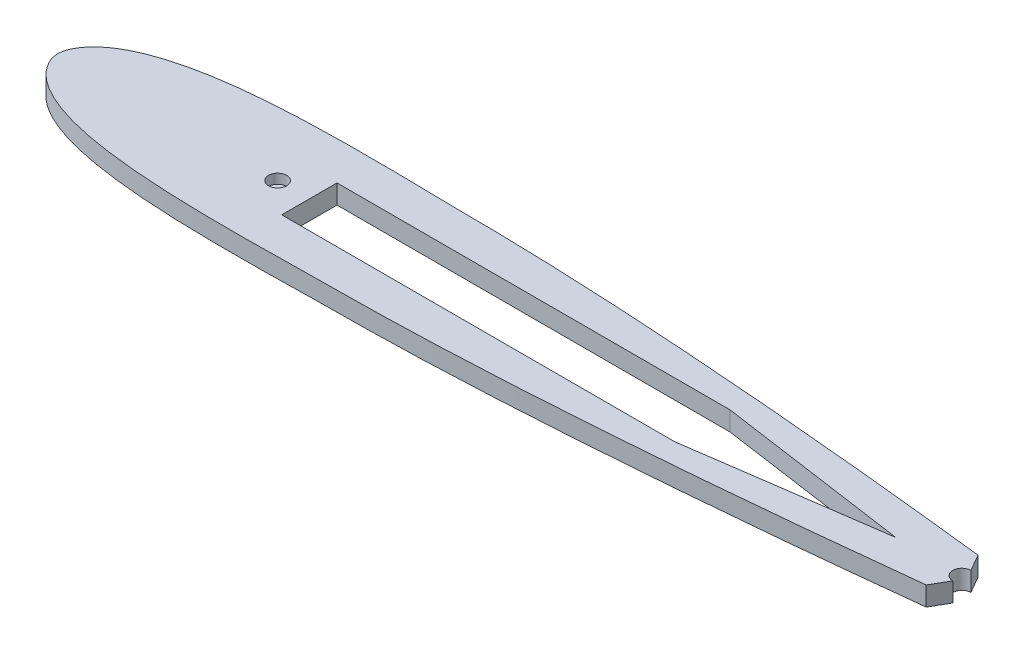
ISO-10303-21;
HEADER;
FILE_DESCRIPTION(('STEP AP214'),'2;1');
FILE_NAME('part.step','',(''),(''),'','','');
FILE_SCHEMA(('AUTOMOTIVE_DESIGN { 1 0 10303 214 1 1 1 1 }'));
ENDSEC;
DATA;
#1=APPLICATION_CONTEXT('core data for automotive mechanical design processes');
#2=APPLICATION_PROTOCOL_DEFINITION('international standard','automotive_design',2000,#1);
#3=PRODUCT_CONTEXT('',#1,'mechanical');
#4=PRODUCT('Part','Part','',(#3));
#5=PRODUCT_RELATED_PRODUCT_CATEGORY('part','',(#4));
#6=PRODUCT_DEFINITION_FORMATION('','',#4);
#7=PRODUCT_DEFINITION_CONTEXT('part definition',#1,'design');
#8=PRODUCT_DEFINITION('design','',#6,#7);
#9=PRODUCT_DEFINITION_SHAPE('','',#8);
#10=(LENGTH_UNIT() NAMED_UNIT(*) SI_UNIT(.MILLI.,.METRE.));
#11=(NAMED_UNIT(*) PLANE_ANGLE_UNIT() SI_UNIT($,.RADIAN.));
#12=(NAMED_UNIT(*) SI_UNIT($,.STERADIAN.) SOLID_ANGLE_UNIT());
#13=UNCERTAINTY_MEASURE_WITH_UNIT(LENGTH_MEASURE(1.E-05),#10,'distance_accuracy_value','');
#14=(GEOMETRIC_REPRESENTATION_CONTEXT(3) GLOBAL_UNCERTAINTY_ASSIGNED_CONTEXT((#13)) GLOBAL_UNIT_ASSIGNED_CONTEXT((#10,
#11,#12)) REPRESENTATION_CONTEXT('',''));
#15=CARTESIAN_POINT('',(0.,0.,0.));
#16=DIRECTION('',(0.,0.,1.));
#17=DIRECTION('',(1.,0.,0.));
#18=AXIS2_PLACEMENT_3D('',#15,#16,#17);
#19=CARTESIAN_POINT('',(90.9739313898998,3.175,-0.00918534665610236));
#20=CARTESIAN_POINT('',(87.4484605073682,3.175,-0.494912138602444));
#21=CARTESIAN_POINT('',(80.9276456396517,3.175,-1.40033353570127));
#22=CARTESIAN_POINT('',(71.3994868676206,3.175,-2.61549267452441));
#23=CARTESIAN_POINT('',(62.3993862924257,3.175,-3.70591169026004));
#24=CARTESIAN_POINT('',(50.4030239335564,3.175,-5.07179537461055));
#25=CARTESIAN_POINT('',(38.4027374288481,3.175,-6.32280849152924));
#26=CARTESIAN_POINT('',(26.3988400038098,3.175,-7.45114437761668));
#27=CARTESIAN_POINT('',(17.3986491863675,3.175,-8.22496515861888));
#28=CARTESIAN_POINT('',(8.39878422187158,3.175,-8.92790611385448));
#29=CARTESIAN_POINT('',(-0.66129225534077,3.175,-9.54776632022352));
#30=CARTESIAN_POINT('',(-9.72109745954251,3.175,-10.0782154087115));
#31=CARTESIAN_POINT('',(-18.7818646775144,3.175,-10.4709636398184));
#32=CARTESIAN_POINT('',(-27.7824556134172,3.175,-10.7611598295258));
#33=CARTESIAN_POINT('',(-35.2249916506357,3.175,-10.7560879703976));
#34=CARTESIAN_POINT('',(-41.164083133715,3.175,-10.8943963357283));
#35=CARTESIAN_POINT('',(-48.6042449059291,3.175,-10.9979998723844));
#36=CARTESIAN_POINT('',(-57.6124184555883,3.175,-11.0025337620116));
#37=CARTESIAN_POINT('',(-66.6196821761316,3.175,-10.5268776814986));
#38=CARTESIAN_POINT('',(-72.3186549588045,3.175,-9.89245533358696));
#39=CARTESIAN_POINT('',(-76.2264160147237,3.175,-9.25170215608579));
#40=CARTESIAN_POINT('',(-79.2288533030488,3.175,-8.5684235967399));
#41=CARTESIAN_POINT('',(-81.6217511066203,3.175,-7.84495662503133));
#42=CARTESIAN_POINT('',(-83.4328835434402,3.175,-7.18300979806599));
#43=CARTESIAN_POINT('',(-85.2546593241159,3.175,-6.35296154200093));
#44=CARTESIAN_POINT('',(-87.1086980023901,3.175,-5.26535725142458));
#45=CARTESIAN_POINT('',(-88.6466709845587,3.175,-3.99340548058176));
#46=CARTESIAN_POINT('',(-90.0011838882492,3.175,-2.29084177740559));
#47=CARTESIAN_POINT('',(-90.9981708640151,3.175,0.));
#48=CARTESIAN_POINT('',(-90.0011838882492,3.175,2.29084177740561));
#49=CARTESIAN_POINT('',(-88.6466709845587,3.175,3.99340548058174));
#50=CARTESIAN_POINT('',(-87.1086980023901,3.175,5.26535725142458));
#51=CARTESIAN_POINT('',(-85.2546593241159,3.175,6.35296154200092));
#52=CARTESIAN_POINT('',(-83.4328835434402,3.175,7.18300979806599));
#53=CARTESIAN_POINT('',(-81.6217511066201,3.175,7.84495662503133));
#54=CARTESIAN_POINT('',(-79.2288533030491,3.175,8.56842359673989));
#55=CARTESIAN_POINT('',(-76.2264160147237,3.175,9.25170215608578));
#56=CARTESIAN_POINT('',(-72.3186549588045,3.175,9.89245533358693));
#57=CARTESIAN_POINT('',(-66.6196821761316,3.175,10.5268776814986));
#58=CARTESIAN_POINT('',(-57.6124184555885,3.175,11.0025337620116));
#59=CARTESIAN_POINT('',(-48.6042449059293,3.175,10.9979998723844));
#60=CARTESIAN_POINT('',(-41.164083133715,3.175,10.8943963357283));
#61=CARTESIAN_POINT('',(-35.2249916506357,3.175,10.7560879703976));
#62=CARTESIAN_POINT('',(-27.7824556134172,3.175,10.7611598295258));
#63=CARTESIAN_POINT('',(-18.7818646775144,3.175,10.4709636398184));
#64=CARTESIAN_POINT('',(-9.72109745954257,3.175,10.0782154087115));
#65=CARTESIAN_POINT('',(-0.661292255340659,3.175,9.54776632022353));
#66=CARTESIAN_POINT('',(8.39878422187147,3.175,8.92790611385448));
#67=CARTESIAN_POINT('',(17.3986491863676,3.175,8.22496515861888));
#68=CARTESIAN_POINT('',(26.3988400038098,3.175,7.45114437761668));
#69=CARTESIAN_POINT('',(38.4027374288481,3.175,6.32280849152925));
#70=CARTESIAN_POINT('',(50.4030239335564,3.175,5.07179537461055));
#71=CARTESIAN_POINT('',(62.3993862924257,3.175,3.70591169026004));
#72=CARTESIAN_POINT('',(71.3994868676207,3.175,2.61549267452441));
#73=CARTESIAN_POINT('',(80.9357363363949,3.175,1.39930170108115));
#74=CARTESIAN_POINT('',(87.4646178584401,3.175,0.492668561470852));
#75=CARTESIAN_POINT('',(90.9981708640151,3.175,0.00584577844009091));
#76=B_SPLINE_CURVE_WITH_KNOTS('',3,(#19,#20,#21,#22,#23,#24,#25,#26,#27,#28,#29,#30,#31,#32,#33,
#34,#35,#36,#37,#38,#39,#40,#41,#42,#43,#44,#45,#46,#47,#48,#49,#50,#51,#52,#53,#54,#55,#56,#57,
#58,#59,#60,#61,#62,#63,#64,#65,#66,#67,#68,#69,#70,#71,#72,#73,#74,#75),.UNSPECIFIED.,.F.,.F.,
(4,1,1,1,1,1,1,1,1,1,1,1,1,1,1,1,1,1,1,1,1,1,1,1,1,1,1,1,1,1,1,1,1,1,1,1,1,1,1,1,1,1,1,1,1,1,1,
1,1,1,1,1,1,1,4),(-0.00432084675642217,0.0246342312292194,0.0492428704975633,0.0738297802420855,
0.0983967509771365,0.147478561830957,0.171994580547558,0.196493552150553,0.220976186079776,
0.245442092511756,0.270380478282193,0.29481296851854,0.319231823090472,0.343641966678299,
0.355360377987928,0.367566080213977,0.404182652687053,0.428636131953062,0.440920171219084,
0.450818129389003,0.460843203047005,0.465945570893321,0.471149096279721,0.476522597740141,
0.482208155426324,0.488618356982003,0.492567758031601,0.5,0.507432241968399,0.511381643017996,
0.517791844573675,0.523477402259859,0.528850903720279,0.534054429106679,0.539156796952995,
0.549181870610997,0.559079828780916,0.571363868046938,0.595817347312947,0.632433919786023,
0.644639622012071,0.656358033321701,0.680768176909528,0.70518703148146,0.729619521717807,
0.754557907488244,0.779023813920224,0.803506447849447,0.828005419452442,0.852521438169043,
0.901603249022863,0.926170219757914,0.950757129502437,0.975365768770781,1.00438720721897),.UNSPECIFIED.);
#77=DIRECTION('',(0.,-1.,0.));
#78=VECTOR('',#77,1.);
#79=SURFACE_OF_LINEAR_EXTRUSION('',#76,#78);
#80=CARTESIAN_POINT('',(90.9739313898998,0.,-0.00918534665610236));
#81=CARTESIAN_POINT('',(87.4484605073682,0.,-0.494912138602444));
#82=CARTESIAN_POINT('',(80.9276456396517,0.,-1.40033353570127));
#83=CARTESIAN_POINT('',(71.3994868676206,0.,-2.61549267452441));
#84=CARTESIAN_POINT('',(62.3993862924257,0.,-3.70591169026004));
#85=CARTESIAN_POINT('',(50.4030239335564,0.,-5.07179537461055));
#86=CARTESIAN_POINT('',(38.4027374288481,0.,-6.32280849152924));
#87=CARTESIAN_POINT('',(26.3988400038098,0.,-7.45114437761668));
#88=CARTESIAN_POINT('',(17.3986491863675,0.,-8.22496515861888));
#89=CARTESIAN_POINT('',(8.39878422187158,0.,-8.92790611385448));
#90=CARTESIAN_POINT('',(-0.66129225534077,0.,-9.54776632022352));
#91=CARTESIAN_POINT('',(-9.72109745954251,0.,-10.0782154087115));
#92=CARTESIAN_POINT('',(-18.7818646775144,0.,-10.4709636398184));
#93=CARTESIAN_POINT('',(-27.7824556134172,0.,-10.7611598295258));
#94=CARTESIAN_POINT('',(-35.2249916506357,0.,-10.7560879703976));
#95=CARTESIAN_POINT('',(-41.164083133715,0.,-10.8943963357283));
#96=CARTESIAN_POINT('',(-48.6042449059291,0.,-10.9979998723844));
#97=CARTESIAN_POINT('',(-57.6124184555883,0.,-11.0025337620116));
#98=CARTESIAN_POINT('',(-66.6196821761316,0.,-10.5268776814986));
#99=CARTESIAN_POINT('',(-72.3186549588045,0.,-9.89245533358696));
#100=CARTESIAN_POINT('',(-76.2264160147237,0.,-9.25170215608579));
#101=CARTESIAN_POINT('',(-79.2288533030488,0.,-8.5684235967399));
#102=CARTESIAN_POINT('',(-81.6217511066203,0.,-7.84495662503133));
#103=CARTESIAN_POINT('',(-83.4328835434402,0.,-7.18300979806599));
#104=CARTESIAN_POINT('',(-85.2546593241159,0.,-6.35296154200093));
#105=CARTESIAN_POINT('',(-87.1086980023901,0.,-5.26535725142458));
#106=CARTESIAN_POINT('',(-88.6466709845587,0.,-3.99340548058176));
#107=CARTESIAN_POINT('',(-90.0011838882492,0.,-2.29084177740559));
#108=CARTESIAN_POINT('',(-90.9981708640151,0.,0.));
#109=CARTESIAN_POINT('',(-90.0011838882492,0.,2.29084177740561));
#110=CARTESIAN_POINT('',(-88.6466709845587,0.,3.99340548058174));
#111=CARTESIAN_POINT('',(-87.1086980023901,0.,5.26535725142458));
#112=CARTESIAN_POINT('',(-85.2546593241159,0.,6.35296154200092));
#113=CARTESIAN_POINT('',(-83.4328835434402,0.,7.18300979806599));
#114=CARTESIAN_POINT('',(-81.6217511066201,0.,7.84495662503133));
#115=CARTESIAN_POINT('',(-79.2288533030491,0.,8.56842359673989));
#116=CARTESIAN_POINT('',(-76.2264160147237,0.,9.25170215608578));
#117=CARTESIAN_POINT('',(-72.3186549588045,0.,9.89245533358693));
#118=CARTESIAN_POINT('',(-66.6196821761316,0.,10.5268776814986));
#119=CARTESIAN_POINT('',(-57.6124184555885,0.,11.0025337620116));
#120=CARTESIAN_POINT('',(-48.6042449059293,0.,10.9979998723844));
#121=CARTESIAN_POINT('',(-41.164083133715,0.,10.8943963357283));
#122=CARTESIAN_POINT('',(-35.2249916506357,0.,10.7560879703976));
#123=CARTESIAN_POINT('',(-27.7824556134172,0.,10.7611598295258));
#124=CARTESIAN_POINT('',(-18.7818646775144,0.,10.4709636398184));
#125=CARTESIAN_POINT('',(-9.72109745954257,0.,10.0782154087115));
#126=CARTESIAN_POINT('',(-0.661292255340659,0.,9.54776632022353));
#127=CARTESIAN_POINT('',(8.39878422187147,0.,8.92790611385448));
#128=CARTESIAN_POINT('',(17.3986491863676,0.,8.22496515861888));
#129=CARTESIAN_POINT('',(26.3988400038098,0.,7.45114437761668));
#130=CARTESIAN_POINT('',(38.4027374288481,0.,6.32280849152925));
#131=CARTESIAN_POINT('',(50.4030239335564,0.,5.07179537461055));
#132=CARTESIAN_POINT('',(62.3993862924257,0.,3.70591169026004));
#133=CARTESIAN_POINT('',(71.3994868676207,0.,2.61549267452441));
#134=CARTESIAN_POINT('',(80.9357363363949,0.,1.39930170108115));
#135=CARTESIAN_POINT('',(87.4646178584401,0.,0.492668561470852));
#136=CARTESIAN_POINT('',(90.9981708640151,0.,0.00584577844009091));
#137=B_SPLINE_CURVE_WITH_KNOTS('',3,(#80,#81,#82,#83,#84,#85,#86,#87,#88,#89,#90,#91,#92,#93,
#94,#95,#96,#97,#98,#99,#100,#101,#102,#103,#104,#105,#106,#107,#108,#109,#110,#111,#112,#113,
#114,#115,#116,#117,#118,#119,#120,#121,#122,#123,#124,#125,#126,#127,#128,#129,#130,#131,#132,
#133,#134,#135,#136),.UNSPECIFIED.,.F.,.F.,(4,1,1,1,1,1,1,1,1,1,1,1,1,1,1,1,1,1,1,1,1,1,1,1,1,1,
1,1,1,1,1,1,1,1,1,1,1,1,1,1,1,1,1,1,1,1,1,1,1,1,1,1,1,1,4),(-0.00432084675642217,
0.0246342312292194,0.0492428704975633,0.0738297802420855,0.0983967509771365,0.147478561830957,
0.171994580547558,0.196493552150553,0.220976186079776,0.245442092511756,0.270380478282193,
0.29481296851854,0.319231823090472,0.343641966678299,0.355360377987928,0.367566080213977,
0.404182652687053,0.428636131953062,0.440920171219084,0.450818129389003,0.460843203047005,
0.465945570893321,0.471149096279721,0.476522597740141,0.482208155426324,0.488618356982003,
0.492567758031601,0.5,0.507432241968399,0.511381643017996,0.517791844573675,0.523477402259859,
0.528850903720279,0.534054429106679,0.539156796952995,0.549181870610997,0.559079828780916,
0.571363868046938,0.595817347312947,0.632433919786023,0.644639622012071,0.656358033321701,
0.680768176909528,0.70518703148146,0.729619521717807,0.754557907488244,0.779023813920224,
0.803506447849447,0.828005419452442,0.852521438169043,0.901603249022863,0.926170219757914,
0.950757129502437,0.975365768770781,1.00438720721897),.UNSPECIFIED.);
#138=CARTESIAN_POINT('',(57.3770100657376,-1.24999999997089E-05,-4.2751341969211));
#139=VERTEX_POINT('',#138);
#140=CARTESIAN_POINT('',(57.3656595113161,-1.24999999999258E-05,4.27642326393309));
#141=VERTEX_POINT('',#140);
#142=EDGE_CURVE('E61',#139,#141,#137,.T.);
#143=ORIENTED_EDGE('',*,*,#142,.T.);
#144=DIRECTION('',(0.,-1.,0.));
#145=VECTOR('',#144,1.);
#146=CARTESIAN_POINT('',(57.3656595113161,1.5874875,4.27642326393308));
#147=LINE('',#146,#145);
#148=CARTESIAN_POINT('',(57.3656738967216,3.175,4.27639834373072));
#149=VERTEX_POINT('',#148);
#150=EDGE_CURVE('E122',#141,#149,#147,.F.);
#151=ORIENTED_EDGE('',*,*,#150,.T.);
#152=CARTESIAN_POINT('',(57.3656765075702,3.175,4.27642133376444));
#153=CARTESIAN_POINT('',(56.0425616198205,3.175,4.42668003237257));
#154=CARTESIAN_POINT('',(48.7242698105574,3.175,5.24680314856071));
#155=CARTESIAN_POINT('',(38.4027374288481,3.175,6.32280849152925));
#156=CARTESIAN_POINT('',(26.3988400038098,3.175,7.45114437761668));
#157=CARTESIAN_POINT('',(17.3986491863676,3.175,8.22496515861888));
#158=CARTESIAN_POINT('',(8.39878422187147,3.175,8.92790611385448));
#159=CARTESIAN_POINT('',(-0.661292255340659,3.175,9.54776632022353));
#160=CARTESIAN_POINT('',(-9.72109745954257,3.175,10.0782154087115));
#161=CARTESIAN_POINT('',(-18.7818646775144,3.175,10.4709636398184));
#162=CARTESIAN_POINT('',(-27.7824556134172,3.175,10.7611598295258));
#163=CARTESIAN_POINT('',(-35.2249916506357,3.175,10.7560879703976));
#164=CARTESIAN_POINT('',(-41.164083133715,3.175,10.8943963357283));
#165=CARTESIAN_POINT('',(-48.6042449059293,3.175,10.9979998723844));
#166=CARTESIAN_POINT('',(-57.6124184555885,3.175,11.0025337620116));
#167=CARTESIAN_POINT('',(-66.6196821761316,3.175,10.5268776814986));
#168=CARTESIAN_POINT('',(-72.3186549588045,3.175,9.89245533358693));
#169=CARTESIAN_POINT('',(-76.2264160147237,3.175,9.25170215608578));
#170=CARTESIAN_POINT('',(-79.2288533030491,3.175,8.56842359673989));
#171=CARTESIAN_POINT('',(-81.6217511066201,3.175,7.84495662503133));
#172=CARTESIAN_POINT('',(-83.4328835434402,3.175,7.18300979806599));
#173=CARTESIAN_POINT('',(-85.2546593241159,3.175,6.35296154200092));
#174=CARTESIAN_POINT('',(-87.1086980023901,3.175,5.26535725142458));
#175=CARTESIAN_POINT('',(-88.6466709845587,3.175,3.99340548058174));
#176=CARTESIAN_POINT('',(-90.0011838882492,3.175,2.29084177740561));
#177=CARTESIAN_POINT('',(-90.9981708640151,3.175,0.));
#178=CARTESIAN_POINT('',(-90.0011838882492,3.175,-2.29084177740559));
#179=CARTESIAN_POINT('',(-88.6466709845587,3.175,-3.99340548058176));
#180=CARTESIAN_POINT('',(-87.1086980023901,3.175,-5.26535725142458));
#181=CARTESIAN_POINT('',(-85.2546593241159,3.175,-6.35296154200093));
#182=CARTESIAN_POINT('',(-83.4328835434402,3.175,-7.18300979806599));
#183=CARTESIAN_POINT('',(-81.6217511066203,3.175,-7.84495662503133));
#184=CARTESIAN_POINT('',(-79.2288533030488,3.175,-8.5684235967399));
#185=CARTESIAN_POINT('',(-76.2264160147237,3.175,-9.25170215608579));
#186=CARTESIAN_POINT('',(-72.3186549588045,3.175,-9.89245533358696));
#187=CARTESIAN_POINT('',(-66.6196821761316,3.175,-10.5268776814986));
#188=CARTESIAN_POINT('',(-57.6124184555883,3.175,-11.0025337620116));
#189=CARTESIAN_POINT('',(-48.6042449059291,3.175,-10.9979998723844));
#190=CARTESIAN_POINT('',(-41.164083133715,3.175,-10.8943963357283));
#191=CARTESIAN_POINT('',(-35.2249916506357,3.175,-10.7560879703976));
#192=CARTESIAN_POINT('',(-27.7824556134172,3.175,-10.7611598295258));
#193=CARTESIAN_POINT('',(-18.7818646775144,3.175,-10.4709636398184));
#194=CARTESIAN_POINT('',(-9.72109745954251,3.175,-10.0782154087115));
#195=CARTESIAN_POINT('',(-0.66129225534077,3.175,-9.54776632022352));
#196=CARTESIAN_POINT('',(8.39878422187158,3.175,-8.92790611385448));
#197=CARTESIAN_POINT('',(17.3986491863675,3.175,-8.22496515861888));
#198=CARTESIAN_POINT('',(26.3988400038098,3.175,-7.45114437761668));
#199=CARTESIAN_POINT('',(38.4027374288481,3.175,-6.32280849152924));
#200=CARTESIAN_POINT('',(48.7280566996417,3.175,-5.24640837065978));
#201=CARTESIAN_POINT('',(56.0501289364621,3.175,-4.42583198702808));
#202=CARTESIAN_POINT('',(57.3770255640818,3.175,-4.27513243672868));
#203=B_SPLINE_CURVE_WITH_KNOTS('',3,(#152,#153,#154,#155,#156,#157,#158,#159,#160,#161,#162,
#163,#164,#165,#166,#167,#168,#169,#170,#171,#172,#173,#174,#175,#176,#177,#178,#179,#180,#181,
#182,#183,#184,#185,#186,#187,#188,#189,#190,#191,#192,#193,#194,#195,#196,#197,#198,#199,#200,
#201,#202),.UNSPECIFIED.,.F.,.F.,(4,1,1,1,1,1,1,1,1,1,1,1,1,1,1,1,1,1,1,1,1,1,1,1,1,1,1,1,1,1,1,
1,1,1,1,1,1,1,1,1,1,1,1,1,1,1,1,1,4),(0.0875313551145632,0.0983657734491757,0.147447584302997,
0.171963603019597,0.196462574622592,0.220945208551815,0.245411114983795,0.270349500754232,
0.294781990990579,0.319200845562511,0.343610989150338,0.355329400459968,0.367535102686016,
0.404151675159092,0.428605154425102,0.440889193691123,0.450787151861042,0.460812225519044,
0.46591459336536,0.47111811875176,0.476491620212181,0.482177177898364,0.488587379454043,
0.492536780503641,0.499969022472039,0.507401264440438,0.511350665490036,0.517760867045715,
0.523446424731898,0.528819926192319,0.534023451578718,0.539125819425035,0.549150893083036,
0.559048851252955,0.571332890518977,0.595786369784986,0.632402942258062,0.644608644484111,
0.65632705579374,0.680737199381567,0.7051560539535,0.729588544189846,0.754526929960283,
0.778992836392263,0.803475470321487,0.827974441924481,0.852490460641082,0.901572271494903,
0.912437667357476),.UNSPECIFIED.);
#204=CARTESIAN_POINT('',(57.3770231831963,3.175,-4.27511147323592));
#205=VERTEX_POINT('',#204);
#206=EDGE_CURVE('E11',#205,#149,#203,.F.);
#207=ORIENTED_EDGE('',*,*,#206,.F.);
#208=DIRECTION('',(0.,-1.,0.));
#209=VECTOR('',#208,1.);
#210=CARTESIAN_POINT('',(57.3770100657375,1.5874875,-4.2751341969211));
#211=LINE('',#210,#209);
#212=EDGE_CURVE('E129',#139,#205,#211,.F.);
#213=ORIENTED_EDGE('',*,*,#212,.F.);
#214=EDGE_LOOP('',(#143,#151,#207,#213));
#215=FACE_BOUND('',#214,.T.);
#216=ADVANCED_FACE('F49',(#215),#79,.F.);
#217=CARTESIAN_POINT('',(-90.6042973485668,3.175,0.0121203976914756));
#218=DIRECTION('',(0.,1.,0.));
#219=DIRECTION('',(0.,0.,1.));
#220=AXIS2_PLACEMENT_3D('',#217,#218,#219);
#221=PLANE('',#220);
#222=DIRECTION('',(-0.499999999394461,0.,0.866025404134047));
#223=VECTOR('',#222,1.);
#224=CARTESIAN_POINT('',(22.2196676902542,3.175,65.1510668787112));
#225=LINE('',#224,#223);
#226=CARTESIAN_POINT('',(58.9739313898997,3.175,1.49081465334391));
#227=VERTEX_POINT('',#226);
#228=EDGE_CURVE('E125',#227,#149,#225,.T.);
#229=ORIENTED_EDGE('',*,*,#228,.F.);
#230=CARTESIAN_POINT('',(58.9739313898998,3.175,-0.00918534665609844));
#231=DIRECTION('',(0.,1.,0.));
#232=DIRECTION('',(0.,0.,1.));
#233=AXIS2_PLACEMENT_3D('',#230,#231,#232);
#234=CIRCLE('',#233,1.5);
#235=CARTESIAN_POINT('',(58.9739313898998,3.175,-1.5091853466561));
#236=VERTEX_POINT('',#235);
#237=EDGE_CURVE('E145',#236,#227,#234,.T.);
#238=ORIENTED_EDGE('',*,*,#237,.F.);
#239=DIRECTION('',(0.500000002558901,0.,0.866025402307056));
#240=VECTOR('',#239,1.);
#241=CARTESIAN_POINT('',(22.2381185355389,3.175,-65.1374792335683));
#242=LINE('',#241,#240);
#243=EDGE_CURVE('E68',#205,#236,#242,.T.);
#244=ORIENTED_EDGE('',*,*,#243,.F.);
#245=ORIENTED_EDGE('',*,*,#206,.T.);
#246=EDGE_LOOP('',(#229,#238,#244,#245));
#247=FACE_BOUND('',#246,.T.);
#248=CARTESIAN_POINT('',(-54.2300686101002,3.175,-0.00918534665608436));
#249=DIRECTION('',(0.,1.,0.));
#250=DIRECTION('',(0.,0.,1.));
#251=AXIS2_PLACEMENT_3D('',#248,#249,#250);
#252=CIRCLE('',#251,1.5);
#253=CARTESIAN_POINT('',(-54.2300686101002,3.175,1.49081465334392));
#254=VERTEX_POINT('',#253);
#255=EDGE_CURVE('E320',#254,#254,#252,.T.);
#256=ORIENTED_EDGE('',*,*,#255,.F.);
#257=EDGE_LOOP('',(#256));
#258=FACE_BOUND('',#257,.T.);
#259=DIRECTION('',(-1.,0.,0.));
#260=VECTOR('',#259,1.);
#261=CARTESIAN_POINT('',(16.0439313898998,3.175,-4.58118534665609));
#262=LINE('',#261,#260);
#263=CARTESIAN_POINT('',(16.0439313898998,3.175,-4.58118534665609));
#264=VERTEX_POINT('',#263);
#265=CARTESIAN_POINT('',(-48.9800686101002,3.175,-4.58118534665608));
#266=VERTEX_POINT('',#265);
#267=EDGE_CURVE('E372',#264,#266,#262,.T.);
#268=ORIENTED_EDGE('',*,*,#267,.F.);
#269=DIRECTION('',(-0.989947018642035,0.,-0.141438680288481));
#270=VECTOR('',#269,1.);
#271=CARTESIAN_POINT('',(48.0439313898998,3.175,-0.0091853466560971));
#272=LINE('',#271,#270);
#273=CARTESIAN_POINT('',(48.0439313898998,3.175,-0.0091853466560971));
#274=VERTEX_POINT('',#273);
#275=EDGE_CURVE('E368',#274,#264,#272,.T.);
#276=ORIENTED_EDGE('',*,*,#275,.F.);
#277=DIRECTION('',(0.989947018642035,0.,-0.141438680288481));
#278=VECTOR('',#277,1.);
#279=CARTESIAN_POINT('',(16.0439313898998,3.175,4.56281465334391));
#280=LINE('',#279,#278);
#281=CARTESIAN_POINT('',(16.0439313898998,3.175,4.56281465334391));
#282=VERTEX_POINT('',#281);
#283=EDGE_CURVE('E364',#282,#274,#280,.T.);
#284=ORIENTED_EDGE('',*,*,#283,.F.);
#285=DIRECTION('',(-1.,0.,0.));
#286=VECTOR('',#285,1.);
#287=CARTESIAN_POINT('',(16.0439313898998,3.175,4.56281465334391));
#288=LINE('',#287,#286);
#289=CARTESIAN_POINT('',(-48.9800686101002,3.175,4.56281465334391));
#290=VERTEX_POINT('',#289);
#291=EDGE_CURVE('E359',#282,#290,#288,.T.);
#292=ORIENTED_EDGE('',*,*,#291,.T.);
#293=DIRECTION('',(0.,0.,1.));
#294=VECTOR('',#293,1.);
#295=CARTESIAN_POINT('',(-48.9800686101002,3.175,-0.00918534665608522));
#296=LINE('',#295,#294);
#297=EDGE_CURVE('E355',#266,#290,#296,.T.);
#298=ORIENTED_EDGE('',*,*,#297,.F.);
#299=EDGE_LOOP('',(#268,#276,#284,#292,#298));
#300=FACE_BOUND('',#299,.T.);
#301=ADVANCED_FACE('F165',(#247,#258,#300),#221,.T.);
#302=CARTESIAN_POINT('',(-90.6042973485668,0.,0.0121203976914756));
#303=DIRECTION('',(0.,1.,0.));
#304=DIRECTION('',(0.,0.,1.));
#305=AXIS2_PLACEMENT_3D('',#302,#303,#304);
#306=PLANE('',#305);
#307=CARTESIAN_POINT('',(-79.2760686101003,0.,-0.00918534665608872));
#308=DIRECTION('',(0.,-1.,0.));
#309=DIRECTION('',(0.,0.,-1.));
#310=AXIS2_PLACEMENT_3D('',#307,#308,#309);
#311=CIRCLE('',#310,1.5);
#312=CARTESIAN_POINT('',(-79.2760686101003,0.,-1.50918534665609));
#313=VERTEX_POINT('',#312);
#314=EDGE_CURVE('E321',#313,#313,#311,.T.);
#315=ORIENTED_EDGE('',*,*,#314,.F.);
#316=EDGE_LOOP('',(#315));
#317=FACE_BOUND('',#316,.T.);
#318=DIRECTION('',(-0.989947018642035,0.,-0.141438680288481));
#319=VECTOR('',#318,1.);
#320=CARTESIAN_POINT('',(48.0439313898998,0.,-0.0091853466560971));
#321=LINE('',#320,#319);
#322=CARTESIAN_POINT('',(48.0439313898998,0.,-0.0091853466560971));
#323=VERTEX_POINT('',#322);
#324=CARTESIAN_POINT('',(16.0439313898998,0.,-4.58118534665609));
#325=VERTEX_POINT('',#324);
#326=EDGE_CURVE('E382',#323,#325,#321,.T.);
#327=ORIENTED_EDGE('',*,*,#326,.T.);
#328=DIRECTION('',(-1.,0.,0.));
#329=VECTOR('',#328,1.);
#330=CARTESIAN_POINT('',(16.0439313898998,0.,-4.58118534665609));
#331=LINE('',#330,#329);
#332=CARTESIAN_POINT('',(-48.9800686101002,0.,-4.58118534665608));
#333=VERTEX_POINT('',#332);
#334=EDGE_CURVE('E386',#325,#333,#331,.T.);
#335=ORIENTED_EDGE('',*,*,#334,.T.);
#336=DIRECTION('',(0.,0.,-1.));
#337=VECTOR('',#336,1.);
#338=CARTESIAN_POINT('',(-48.9800686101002,0.,-0.00918534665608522));
#339=LINE('',#338,#337);
#340=CARTESIAN_POINT('',(-48.9800686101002,0.,4.56281465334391));
#341=VERTEX_POINT('',#340);
#342=EDGE_CURVE('E360',#341,#333,#339,.T.);
#343=ORIENTED_EDGE('',*,*,#342,.F.);
#344=DIRECTION('',(-1.,0.,0.));
#345=VECTOR('',#344,1.);
#346=CARTESIAN_POINT('',(16.0439313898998,0.,4.56281465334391));
#347=LINE('',#346,#345);
#348=CARTESIAN_POINT('',(16.0439313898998,0.,4.56281465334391));
#349=VERTEX_POINT('',#348);
#350=EDGE_CURVE('E354',#349,#341,#347,.T.);
#351=ORIENTED_EDGE('',*,*,#350,.F.);
#352=DIRECTION('',(0.989947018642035,0.,-0.141438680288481));
#353=VECTOR('',#352,1.);
#354=CARTESIAN_POINT('',(16.0439313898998,0.,4.56281465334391));
#355=LINE('',#354,#353);
#356=EDGE_CURVE('E378',#349,#323,#355,.T.);
#357=ORIENTED_EDGE('',*,*,#356,.T.);
#358=EDGE_LOOP('',(#327,#335,#343,#351,#357));
#359=FACE_BOUND('',#358,.T.);
#360=CARTESIAN_POINT('',(58.9739313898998,0.,-0.00918534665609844));
#361=DIRECTION('',(0.,1.,0.));
#362=DIRECTION('',(0.,0.,1.));
#363=AXIS2_PLACEMENT_3D('',#360,#361,#362);
#364=CIRCLE('',#363,1.5);
#365=CARTESIAN_POINT('',(58.9739313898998,0.,-1.5091853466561));
#366=VERTEX_POINT('',#365);
#367=CARTESIAN_POINT('',(58.9739313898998,0.,1.49081465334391));
#368=VERTEX_POINT('',#367);
#369=EDGE_CURVE('E137',#366,#368,#364,.T.);
#370=ORIENTED_EDGE('',*,*,#369,.T.);
#371=DIRECTION('',(-0.499999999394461,0.,0.866025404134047));
#372=VECTOR('',#371,1.);
#373=CARTESIAN_POINT('',(22.2196676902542,0.,65.1510668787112));
#374=LINE('',#373,#372);
#375=EDGE_CURVE('E76',#368,#141,#374,.T.);
#376=ORIENTED_EDGE('',*,*,#375,.T.);
#377=ORIENTED_EDGE('',*,*,#142,.F.);
#378=DIRECTION('',(0.500000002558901,0.,0.866025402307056));
#379=VECTOR('',#378,1.);
#380=CARTESIAN_POINT('',(22.2381185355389,0.,-65.1374792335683));
#381=LINE('',#380,#379);
#382=EDGE_CURVE('E427',#139,#366,#381,.T.);
#383=ORIENTED_EDGE('',*,*,#382,.T.);
#384=EDGE_LOOP('',(#370,#376,#377,#383));
#385=FACE_BOUND('',#384,.T.);
#386=ADVANCED_FACE('F134',(#317,#359,#385),#306,.F.);
#387=CARTESIAN_POINT('',(16.0439313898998,0.,-4.58118534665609));
#388=DIRECTION('',(0.,0.,-1.));
#389=DIRECTION('',(-1.,0.,0.));
#390=AXIS2_PLACEMENT_3D('',#387,#388,#389);
#391=PLANE('',#390);
#392=ORIENTED_EDGE('',*,*,#267,.T.);
#393=DIRECTION('',(0.,1.,0.));
#394=VECTOR('',#393,1.);
#395=CARTESIAN_POINT('',(-48.9800686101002,0.,-4.58118534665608));
#396=LINE('',#395,#394);
#397=EDGE_CURVE('E337',#333,#266,#396,.T.);
#398=ORIENTED_EDGE('',*,*,#397,.F.);
#399=ORIENTED_EDGE('',*,*,#334,.F.);
#400=DIRECTION('',(0.,1.,0.));
#401=VECTOR('',#400,1.);
#402=CARTESIAN_POINT('',(16.0439313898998,0.,-4.58118534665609));
#403=LINE('',#402,#401);
#404=EDGE_CURVE('E342',#325,#264,#403,.T.);
#405=ORIENTED_EDGE('',*,*,#404,.T.);
#406=EDGE_LOOP('',(#392,#398,#399,#405));
#407=FACE_BOUND('',#406,.T.);
#408=ADVANCED_FACE('F178',(#407),#391,.F.);
#409=CARTESIAN_POINT('',(48.0439313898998,0.,-0.0091853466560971));
#410=DIRECTION('',(0.141438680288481,0.,-0.989947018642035));
#411=DIRECTION('',(-0.989947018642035,0.,-0.141438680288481));
#412=AXIS2_PLACEMENT_3D('',#409,#410,#411);
#413=PLANE('',#412);
#414=ORIENTED_EDGE('',*,*,#275,.T.);
#415=ORIENTED_EDGE('',*,*,#404,.F.);
#416=ORIENTED_EDGE('',*,*,#326,.F.);
#417=DIRECTION('',(0.,1.,0.));
#418=VECTOR('',#417,1.);
#419=CARTESIAN_POINT('',(48.0439313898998,0.,-0.0091853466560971));
#420=LINE('',#419,#418);
#421=EDGE_CURVE('E345',#323,#274,#420,.T.);
#422=ORIENTED_EDGE('',*,*,#421,.T.);
#423=EDGE_LOOP('',(#414,#415,#416,#422));
#424=FACE_BOUND('',#423,.T.);
#425=ADVANCED_FACE('F184',(#424),#413,.F.);
#426=CARTESIAN_POINT('',(16.0439313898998,0.,4.56281465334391));
#427=DIRECTION('',(0.141438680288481,0.,0.989947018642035));
#428=DIRECTION('',(0.989947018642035,0.,-0.141438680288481));
#429=AXIS2_PLACEMENT_3D('',#426,#427,#428);
#430=PLANE('',#429);
#431=ORIENTED_EDGE('',*,*,#283,.T.);
#432=ORIENTED_EDGE('',*,*,#421,.F.);
#433=ORIENTED_EDGE('',*,*,#356,.F.);
#434=DIRECTION('',(0.,1.,0.));
#435=VECTOR('',#434,1.);
#436=CARTESIAN_POINT('',(16.0439313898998,0.,4.56281465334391));
#437=LINE('',#436,#435);
#438=EDGE_CURVE('E348',#349,#282,#437,.T.);
#439=ORIENTED_EDGE('',*,*,#438,.T.);
#440=EDGE_LOOP('',(#431,#432,#433,#439));
#441=FACE_BOUND('',#440,.T.);
#442=ADVANCED_FACE('F222',(#441),#430,.F.);
#443=CARTESIAN_POINT('',(16.0439313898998,0.,4.56281465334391));
#444=DIRECTION('',(0.,0.,-1.));
#445=DIRECTION('',(-1.,0.,0.));
#446=AXIS2_PLACEMENT_3D('',#443,#444,#445);
#447=PLANE('',#446);
#448=ORIENTED_EDGE('',*,*,#291,.F.);
#449=ORIENTED_EDGE('',*,*,#438,.F.);
#450=ORIENTED_EDGE('',*,*,#350,.T.);
#451=DIRECTION('',(0.,1.,0.));
#452=VECTOR('',#451,1.);
#453=CARTESIAN_POINT('',(-48.9800686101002,0.,4.56281465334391));
#454=LINE('',#453,#452);
#455=EDGE_CURVE('E351',#341,#290,#454,.T.);
#456=ORIENTED_EDGE('',*,*,#455,.T.);
#457=EDGE_LOOP('',(#448,#449,#450,#456));
#458=FACE_BOUND('',#457,.T.);
#459=ADVANCED_FACE('F232',(#458),#447,.T.);
#460=CARTESIAN_POINT('',(-48.9800686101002,0.,-0.00918534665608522));
#461=DIRECTION('',(-1.,0.,0.));
#462=DIRECTION('',(0.,0.,1.));
#463=AXIS2_PLACEMENT_3D('',#460,#461,#462);
#464=PLANE('',#463);
#465=ORIENTED_EDGE('',*,*,#297,.T.);
#466=ORIENTED_EDGE('',*,*,#455,.F.);
#467=ORIENTED_EDGE('',*,*,#342,.T.);
#468=ORIENTED_EDGE('',*,*,#397,.T.);
#469=EDGE_LOOP('',(#465,#466,#467,#468));
#470=FACE_BOUND('',#469,.T.);
#471=ADVANCED_FACE('F175',(#470),#464,.F.);
#472=CARTESIAN_POINT('',(58.9739313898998,0.,-0.00918534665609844));
#473=DIRECTION('',(0.,1.,0.));
#474=DIRECTION('',(0.,0.,1.));
#475=AXIS2_PLACEMENT_3D('',#472,#473,#474);
#476=CYLINDRICAL_SURFACE('',#475,1.5);
#477=ORIENTED_EDGE('',*,*,#237,.T.);
#478=DIRECTION('',(0.,1.,0.));
#479=VECTOR('',#478,1.);
#480=CARTESIAN_POINT('',(58.9739313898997,0.,1.49081465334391));
#481=LINE('',#480,#479);
#482=EDGE_CURVE('E330',#368,#227,#481,.T.);
#483=ORIENTED_EDGE('',*,*,#482,.F.);
#484=ORIENTED_EDGE('',*,*,#369,.F.);
#485=DIRECTION('',(0.,1.,0.));
#486=VECTOR('',#485,1.);
#487=CARTESIAN_POINT('',(58.9739313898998,0.,-1.5091853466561));
#488=LINE('',#487,#486);
#489=EDGE_CURVE('E424',#366,#236,#488,.T.);
#490=ORIENTED_EDGE('',*,*,#489,.T.);
#491=EDGE_LOOP('',(#477,#483,#484,#490));
#492=FACE_BOUND('',#491,.T.);
#493=ADVANCED_FACE('F250',(#492),#476,.F.);
#494=CARTESIAN_POINT('',(-54.2300686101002,1.5875,-0.00918534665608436));
#495=DIRECTION('',(0.,1.,0.));
#496=DIRECTION('',(0.,0.,1.));
#497=AXIS2_PLACEMENT_3D('',#494,#495,#496);
#498=CYLINDRICAL_SURFACE('',#497,1.5);
#499=CARTESIAN_POINT('',(-54.2300686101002,1.5875,-0.00918534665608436));
#500=DIRECTION('',(0.,1.,0.));
#501=DIRECTION('',(0.,0.,1.));
#502=AXIS2_PLACEMENT_3D('',#499,#500,#501);
#503=CIRCLE('',#502,1.5);
#504=CARTESIAN_POINT('',(-54.2300686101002,1.5875,1.49081465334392));
#505=VERTEX_POINT('',#504);
#506=EDGE_CURVE('E327',#505,#505,#503,.T.);
#507=ORIENTED_EDGE('',*,*,#506,.F.);
#508=EDGE_LOOP('',(#507));
#509=FACE_BOUND('',#508,.T.);
#510=ORIENTED_EDGE('',*,*,#255,.T.);
#511=EDGE_LOOP('',(#510));
#512=FACE_BOUND('',#511,.T.);
#513=ADVANCED_FACE('F262',(#509,#512),#498,.F.);
#514=CARTESIAN_POINT('',(-54.2300686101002,1.5875,-0.00918534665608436));
#515=DIRECTION('',(0.,1.,0.));
#516=DIRECTION('',(0.,0.,1.));
#517=AXIS2_PLACEMENT_3D('',#514,#515,#516);
#518=PLANE('',#517);
#519=ORIENTED_EDGE('',*,*,#506,.T.);
#520=EDGE_LOOP('',(#519));
#521=FACE_BOUND('',#520,.T.);
#522=ADVANCED_FACE('F272',(#521),#518,.T.);
#523=CARTESIAN_POINT('',(-79.2760686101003,1.5875,-0.00918534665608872));
#524=DIRECTION('',(0.,-1.,0.));
#525=DIRECTION('',(0.,0.,-1.));
#526=AXIS2_PLACEMENT_3D('',#523,#524,#525);
#527=CYLINDRICAL_SURFACE('',#526,1.5);
#528=CARTESIAN_POINT('',(-79.2760686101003,1.5875,-0.00918534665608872));
#529=DIRECTION('',(0.,-1.,0.));
#530=DIRECTION('',(0.,0.,-1.));
#531=AXIS2_PLACEMENT_3D('',#528,#529,#530);
#532=CIRCLE('',#531,1.5);
#533=CARTESIAN_POINT('',(-79.2760686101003,1.5875,-1.50918534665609));
#534=VERTEX_POINT('',#533);
#535=EDGE_CURVE('E318',#534,#534,#532,.T.);
#536=ORIENTED_EDGE('',*,*,#535,.F.);
#537=EDGE_LOOP('',(#536));
#538=FACE_BOUND('',#537,.T.);
#539=ORIENTED_EDGE('',*,*,#314,.T.);
#540=EDGE_LOOP('',(#539));
#541=FACE_BOUND('',#540,.T.);
#542=ADVANCED_FACE('F282',(#538,#541),#527,.F.);
#543=CARTESIAN_POINT('',(-79.2760686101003,1.5875,-0.00918534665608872));
#544=DIRECTION('',(0.,-1.,0.));
#545=DIRECTION('',(0.,0.,-1.));
#546=AXIS2_PLACEMENT_3D('',#543,#544,#545);
#547=PLANE('',#546);
#548=ORIENTED_EDGE('',*,*,#535,.T.);
#549=EDGE_LOOP('',(#548));
#550=FACE_BOUND('',#549,.T.);
#551=ADVANCED_FACE('F197',(#550),#547,.T.);
#552=CARTESIAN_POINT('',(58.9739313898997,-2.49999999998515E-05,1.49081465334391));
#553=DIRECTION('',(-0.866025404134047,0.,-0.499999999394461));
#554=DIRECTION('',(-0.499999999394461,0.,0.866025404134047));
#555=AXIS2_PLACEMENT_3D('',#552,#553,#554);
#556=PLANE('',#555);
#557=ORIENTED_EDGE('',*,*,#228,.T.);
#558=ORIENTED_EDGE('',*,*,#150,.F.);
#559=ORIENTED_EDGE('',*,*,#375,.F.);
#560=ORIENTED_EDGE('',*,*,#482,.T.);
#561=EDGE_LOOP('',(#557,#558,#559,#560));
#562=FACE_BOUND('',#561,.T.);
#563=ADVANCED_FACE('F123',(#562),#556,.F.);
#564=CARTESIAN_POINT('',(58.9739313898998,-2.49999999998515E-05,-1.5091853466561));
#565=DIRECTION('',(-0.866025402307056,0.,0.500000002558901));
#566=DIRECTION('',(0.500000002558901,0.,0.866025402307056));
#567=AXIS2_PLACEMENT_3D('',#564,#565,#566);
#568=PLANE('',#567);
#569=ORIENTED_EDGE('',*,*,#243,.T.);
#570=ORIENTED_EDGE('',*,*,#489,.F.);
#571=ORIENTED_EDGE('',*,*,#382,.F.);
#572=ORIENTED_EDGE('',*,*,#212,.T.);
#573=EDGE_LOOP('',(#569,#570,#571,#572));
#574=FACE_BOUND('',#573,.T.);
#575=ADVANCED_FACE('F305',(#574),#568,.F.);
#576=CLOSED_SHELL('',(#216,#301,#386,#408,#425,#442,#459,#471,#493,#513,#522,#542,#551,#563,#575));
#577=MANIFOLD_SOLID_BREP('B2',#576);
#578=ADVANCED_BREP_SHAPE_REPRESENTATION('',(#18,#577),#14);
#579=SHAPE_DEFINITION_REPRESENTATION(#9,#578);
ENDSEC;
END-ISO-10303-21;
